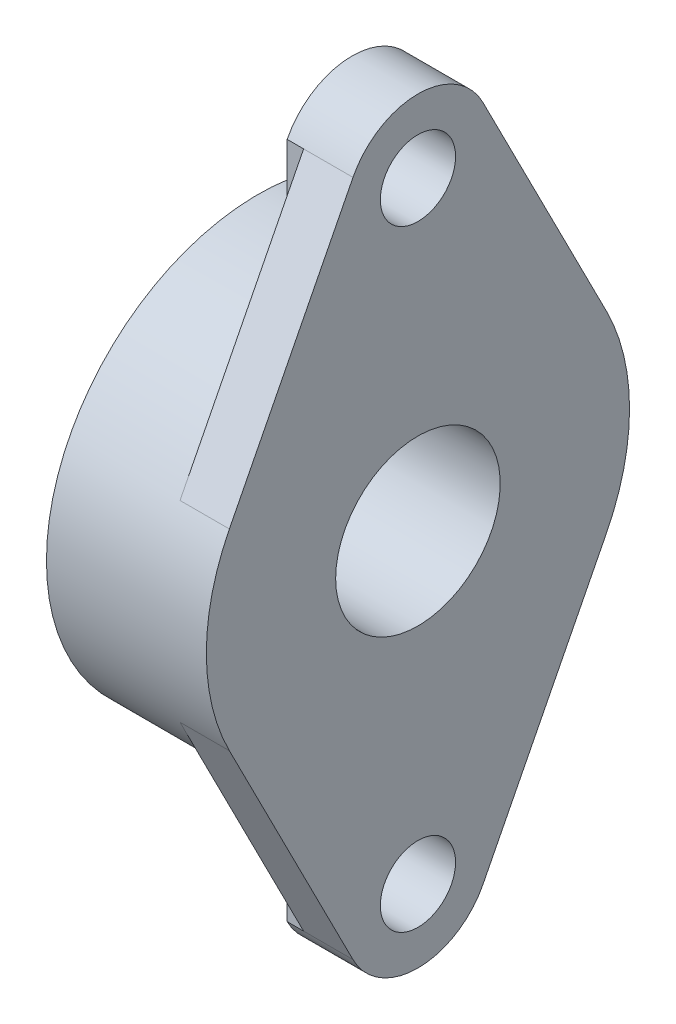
ISO-10303-21;
HEADER;
FILE_DESCRIPTION(('STEP AP214'),'2;1');
FILE_NAME('part.step','',(''),(''),'','','');
FILE_SCHEMA(('AUTOMOTIVE_DESIGN { 1 0 10303 214 1 1 1 1 }'));
ENDSEC;
DATA;
#1=APPLICATION_CONTEXT('core data for automotive mechanical design processes');
#2=APPLICATION_PROTOCOL_DEFINITION('international standard','automotive_design',2000,#1);
#3=PRODUCT_CONTEXT('',#1,'mechanical');
#4=PRODUCT('Part','Part','',(#3));
#5=PRODUCT_RELATED_PRODUCT_CATEGORY('part','',(#4));
#6=PRODUCT_DEFINITION_FORMATION('','',#4);
#7=PRODUCT_DEFINITION_CONTEXT('part definition',#1,'design');
#8=PRODUCT_DEFINITION('design','',#6,#7);
#9=PRODUCT_DEFINITION_SHAPE('','',#8);
#10=(LENGTH_UNIT() NAMED_UNIT(*) SI_UNIT(.MILLI.,.METRE.));
#11=(NAMED_UNIT(*) PLANE_ANGLE_UNIT() SI_UNIT($,.RADIAN.));
#12=(NAMED_UNIT(*) SI_UNIT($,.STERADIAN.) SOLID_ANGLE_UNIT());
#13=UNCERTAINTY_MEASURE_WITH_UNIT(LENGTH_MEASURE(1.E-05),#10,'distance_accuracy_value','');
#14=(GEOMETRIC_REPRESENTATION_CONTEXT(3) GLOBAL_UNCERTAINTY_ASSIGNED_CONTEXT((#13)) GLOBAL_UNIT_ASSIGNED_CONTEXT((#10,
#11,#12)) REPRESENTATION_CONTEXT('',''));
#15=CARTESIAN_POINT('',(0.,0.,0.));
#16=DIRECTION('',(0.,0.,1.));
#17=DIRECTION('',(1.,0.,0.));
#18=AXIS2_PLACEMENT_3D('',#15,#16,#17);
#19=CARTESIAN_POINT('',(-10.5,-72.3442608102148,-40.0986025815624));
#20=DIRECTION('',(-1.,0.,0.));
#21=DIRECTION('',(0.,0.,1.));
#22=AXIS2_PLACEMENT_3D('',#19,#20,#21);
#23=PLANE('',#22);
#24=DIRECTION('',(0.,-1.,0.));
#25=VECTOR('',#24,1.);
#26=CARTESIAN_POINT('',(-10.5,-57.4312973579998,-13.8117408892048));
#27=LINE('',#26,#25);
#28=CARTESIAN_POINT('',(-10.5,-42.8279793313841,-13.8117408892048));
#29=VERTEX_POINT('',#28);
#30=CARTESIAN_POINT('',(-10.5,-72.0346153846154,-13.8117408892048));
#31=VERTEX_POINT('',#30);
#32=EDGE_CURVE('E71',#29,#31,#27,.T.);
#33=ORIENTED_EDGE('',*,*,#32,.F.);
#34=CARTESIAN_POINT('',(-10.5,0.,0.));
#35=DIRECTION('',(-1.,0.,0.));
#36=DIRECTION('',(0.,0.,1.));
#37=AXIS2_PLACEMENT_3D('',#34,#35,#36);
#38=CIRCLE('',#37,45.);
#39=CARTESIAN_POINT('',(-10.5,-20.4270445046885,-40.096581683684));
#40=VERTEX_POINT('',#39);
#41=EDGE_CURVE('E208',#40,#29,#38,.T.);
#42=ORIENTED_EDGE('',*,*,#41,.F.);
#43=DIRECTION('',(0.,0.891080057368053,-0.453846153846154));
#44=VECTOR('',#43,1.);
#45=CARTESIAN_POINT('',(-10.5,-46.2288461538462,-26.9551717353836));
#46=LINE('',#45,#44);
#47=EDGE_CURVE('E308',#31,#40,#46,.T.);
#48=ORIENTED_EDGE('',*,*,#47,.F.);
#49=EDGE_LOOP('',(#33,#42,#48));
#50=FACE_BOUND('',#49,.T.);
#51=ADVANCED_FACE('F16',(#50),#23,.T.);
#52=CARTESIAN_POINT('',(-14.,-72.0346153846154,-13.8117408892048));
#53=DIRECTION('',(0.,0.,-1.));
#54=DIRECTION('',(0.,1.,0.));
#55=AXIS2_PLACEMENT_3D('',#52,#53,#54);
#56=PLANE('',#55);
#57=DIRECTION('',(0.,-1.,0.));
#58=VECTOR('',#57,1.);
#59=CARTESIAN_POINT('',(-14.,-61.8523497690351,-13.8117408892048));
#60=LINE('',#59,#58);
#61=CARTESIAN_POINT('',(-14.,-42.8279793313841,-13.8117408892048));
#62=VERTEX_POINT('',#61);
#63=CARTESIAN_POINT('',(-14.,-72.0346153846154,-13.8117408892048));
#64=VERTEX_POINT('',#63);
#65=EDGE_CURVE('E65',#62,#64,#60,.T.);
#66=ORIENTED_EDGE('',*,*,#65,.F.);
#67=DIRECTION('',(-1.,0.,0.));
#68=VECTOR('',#67,1.);
#69=CARTESIAN_POINT('',(-17.,-42.8279793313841,-13.8117408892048));
#70=LINE('',#69,#68);
#71=EDGE_CURVE('E300',#29,#62,#70,.T.);
#72=ORIENTED_EDGE('',*,*,#71,.F.);
#73=ORIENTED_EDGE('',*,*,#32,.T.);
#74=DIRECTION('',(1.,0.,0.));
#75=VECTOR('',#74,1.);
#76=CARTESIAN_POINT('',(-7.,-72.0346153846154,-13.8117408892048));
#77=LINE('',#76,#75);
#78=EDGE_CURVE('E316',#64,#31,#77,.T.);
#79=ORIENTED_EDGE('',*,*,#78,.F.);
#80=EDGE_LOOP('',(#66,#72,#73,#79));
#81=FACE_BOUND('',#80,.T.);
#82=ADVANCED_FACE('F482',(#81),#56,.T.);
#83=CARTESIAN_POINT('',(-10.5,20.1173989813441,-40.0986025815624));
#84=DIRECTION('',(-1.,0.,0.));
#85=DIRECTION('',(0.,0.,1.));
#86=AXIS2_PLACEMENT_3D('',#83,#84,#85);
#87=PLANE('',#86);
#88=CARTESIAN_POINT('',(-10.5,0.,0.));
#89=DIRECTION('',(-1.,0.,0.));
#90=DIRECTION('',(0.,0.,1.));
#91=AXIS2_PLACEMENT_3D('',#88,#89,#90);
#92=CIRCLE('',#91,45.);
#93=CARTESIAN_POINT('',(-10.5,42.8279793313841,-13.8117408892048));
#94=VERTEX_POINT('',#93);
#95=CARTESIAN_POINT('',(-10.5,20.4270444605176,-40.0965817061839));
#96=VERTEX_POINT('',#95);
#97=EDGE_CURVE('E360',#94,#96,#92,.T.);
#98=ORIENTED_EDGE('',*,*,#97,.F.);
#99=DIRECTION('',(0.,-1.,0.));
#100=VECTOR('',#99,1.);
#101=CARTESIAN_POINT('',(-10.5,57.4312973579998,-13.8117408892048));
#102=LINE('',#101,#100);
#103=CARTESIAN_POINT('',(-10.5,72.0346153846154,-13.8117408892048));
#104=VERTEX_POINT('',#103);
#105=EDGE_CURVE('E270',#104,#94,#102,.T.);
#106=ORIENTED_EDGE('',*,*,#105,.F.);
#107=DIRECTION('',(0.,0.891080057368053,0.453846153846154));
#108=VECTOR('',#107,1.);
#109=CARTESIAN_POINT('',(-10.5,46.2288461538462,-26.9551717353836));
#110=LINE('',#109,#108);
#111=EDGE_CURVE('E203',#96,#104,#110,.T.);
#112=ORIENTED_EDGE('',*,*,#111,.F.);
#113=EDGE_LOOP('',(#98,#106,#112));
#114=FACE_BOUND('',#113,.T.);
#115=ADVANCED_FACE('F371',(#114),#87,.T.);
#116=CARTESIAN_POINT('',(-14.,42.8279793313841,-13.8117408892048));
#117=DIRECTION('',(0.,0.,-1.));
#118=DIRECTION('',(0.,1.,0.));
#119=AXIS2_PLACEMENT_3D('',#116,#117,#118);
#120=PLANE('',#119);
#121=DIRECTION('',(0.,-1.,0.));
#122=VECTOR('',#121,1.);
#123=CARTESIAN_POINT('',(-14.,61.8523497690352,-13.8117408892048));
#124=LINE('',#123,#122);
#125=CARTESIAN_POINT('',(-14.,72.0346153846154,-13.8117408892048));
#126=VERTEX_POINT('',#125);
#127=CARTESIAN_POINT('',(-14.,42.8279793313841,-13.8117408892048));
#128=VERTEX_POINT('',#127);
#129=EDGE_CURVE('E245',#126,#128,#124,.T.);
#130=ORIENTED_EDGE('',*,*,#129,.F.);
#131=DIRECTION('',(-1.,0.,0.));
#132=VECTOR('',#131,1.);
#133=CARTESIAN_POINT('',(-7.,72.0346153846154,-13.8117408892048));
#134=LINE('',#133,#132);
#135=EDGE_CURVE('E197',#104,#126,#134,.T.);
#136=ORIENTED_EDGE('',*,*,#135,.F.);
#137=ORIENTED_EDGE('',*,*,#105,.T.);
#138=DIRECTION('',(1.,0.,0.));
#139=VECTOR('',#138,1.);
#140=CARTESIAN_POINT('',(-17.,42.8279793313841,-13.8117408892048));
#141=LINE('',#140,#139);
#142=EDGE_CURVE('E215',#128,#94,#141,.T.);
#143=ORIENTED_EDGE('',*,*,#142,.F.);
#144=EDGE_LOOP('',(#130,#136,#137,#143));
#145=FACE_BOUND('',#144,.T.);
#146=ADVANCED_FACE('F366',(#145),#120,.T.);
#147=CARTESIAN_POINT('',(-14.,-42.8279793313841,13.8117408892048));
#148=DIRECTION('',(0.,0.,1.));
#149=DIRECTION('',(0.,-1.,0.));
#150=AXIS2_PLACEMENT_3D('',#147,#148,#149);
#151=PLANE('',#150);
#152=DIRECTION('',(0.,1.,0.));
#153=VECTOR('',#152,1.);
#154=CARTESIAN_POINT('',(-14.,-61.8523497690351,13.8117408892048));
#155=LINE('',#154,#153);
#156=CARTESIAN_POINT('',(-14.,-72.0346153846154,13.8117408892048));
#157=VERTEX_POINT('',#156);
#158=CARTESIAN_POINT('',(-14.,-42.8279793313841,13.8117408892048));
#159=VERTEX_POINT('',#158);
#160=EDGE_CURVE('E59',#157,#159,#155,.T.);
#161=ORIENTED_EDGE('',*,*,#160,.F.);
#162=DIRECTION('',(-1.,0.,0.));
#163=VECTOR('',#162,1.);
#164=CARTESIAN_POINT('',(-7.,-72.0346153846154,13.8117408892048));
#165=LINE('',#164,#163);
#166=CARTESIAN_POINT('',(-10.5,-72.0346153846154,13.8117408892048));
#167=VERTEX_POINT('',#166);
#168=EDGE_CURVE('E257',#167,#157,#165,.T.);
#169=ORIENTED_EDGE('',*,*,#168,.F.);
#170=DIRECTION('',(0.,1.,0.));
#171=VECTOR('',#170,1.);
#172=CARTESIAN_POINT('',(-10.5,-72.0346153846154,13.8117408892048));
#173=LINE('',#172,#171);
#174=CARTESIAN_POINT('',(-10.5,-42.8279793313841,13.8117408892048));
#175=VERTEX_POINT('',#174);
#176=EDGE_CURVE('E251',#175,#167,#173,.F.);
#177=ORIENTED_EDGE('',*,*,#176,.F.);
#178=DIRECTION('',(1.,0.,0.));
#179=VECTOR('',#178,1.);
#180=CARTESIAN_POINT('',(-17.,-42.8279793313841,13.8117408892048));
#181=LINE('',#180,#179);
#182=EDGE_CURVE('E277',#159,#175,#181,.T.);
#183=ORIENTED_EDGE('',*,*,#182,.F.);
#184=EDGE_LOOP('',(#161,#169,#177,#183));
#185=FACE_BOUND('',#184,.T.);
#186=ADVANCED_FACE('F432',(#185),#151,.T.);
#187=CARTESIAN_POINT('',(-10.5,20.1173990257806,13.8117408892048));
#188=DIRECTION('',(-1.,0.,0.));
#189=DIRECTION('',(0.,0.,1.));
#190=AXIS2_PLACEMENT_3D('',#187,#188,#189);
#191=PLANE('',#190);
#192=DIRECTION('',(0.,1.,0.));
#193=VECTOR('',#192,1.);
#194=CARTESIAN_POINT('',(-10.5,57.4312973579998,13.8117408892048));
#195=LINE('',#194,#193);
#196=CARTESIAN_POINT('',(-10.5,42.8279793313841,13.8117408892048));
#197=VERTEX_POINT('',#196);
#198=CARTESIAN_POINT('',(-10.5,72.0346153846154,13.8117408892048));
#199=VERTEX_POINT('',#198);
#200=EDGE_CURVE('E133',#197,#199,#195,.T.);
#201=ORIENTED_EDGE('',*,*,#200,.F.);
#202=CARTESIAN_POINT('',(-10.5,0.,0.));
#203=DIRECTION('',(-1.,0.,0.));
#204=DIRECTION('',(0.,0.,1.));
#205=AXIS2_PLACEMENT_3D('',#202,#203,#204);
#206=CIRCLE('',#205,45.);
#207=CARTESIAN_POINT('',(-10.5,20.4270445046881,40.0965816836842));
#208=VERTEX_POINT('',#207);
#209=EDGE_CURVE('E184',#208,#197,#206,.T.);
#210=ORIENTED_EDGE('',*,*,#209,.F.);
#211=DIRECTION('',(0.,-0.891080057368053,0.453846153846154));
#212=VECTOR('',#211,1.);
#213=CARTESIAN_POINT('',(-10.5,46.2288461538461,26.9551717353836));
#214=LINE('',#213,#212);
#215=EDGE_CURVE('E274',#199,#208,#214,.T.);
#216=ORIENTED_EDGE('',*,*,#215,.F.);
#217=EDGE_LOOP('',(#201,#210,#216));
#218=FACE_BOUND('',#217,.T.);
#219=ADVANCED_FACE('F420',(#218),#191,.T.);
#220=CARTESIAN_POINT('',(-14.,72.0346153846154,13.8117408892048));
#221=DIRECTION('',(0.,0.,1.));
#222=DIRECTION('',(0.,-1.,0.));
#223=AXIS2_PLACEMENT_3D('',#220,#221,#222);
#224=PLANE('',#223);
#225=DIRECTION('',(0.,1.,0.));
#226=VECTOR('',#225,1.);
#227=CARTESIAN_POINT('',(-14.,61.8523497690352,13.8117408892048));
#228=LINE('',#227,#226);
#229=CARTESIAN_POINT('',(-14.,42.8279793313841,13.8117408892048));
#230=VERTEX_POINT('',#229);
#231=CARTESIAN_POINT('',(-14.,72.0346153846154,13.8117408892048));
#232=VERTEX_POINT('',#231);
#233=EDGE_CURVE('E128',#230,#232,#228,.T.);
#234=ORIENTED_EDGE('',*,*,#233,.F.);
#235=DIRECTION('',(-1.,0.,0.));
#236=VECTOR('',#235,1.);
#237=CARTESIAN_POINT('',(-17.,42.8279793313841,13.8117408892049));
#238=LINE('',#237,#236);
#239=EDGE_CURVE('E267',#197,#230,#238,.T.);
#240=ORIENTED_EDGE('',*,*,#239,.F.);
#241=ORIENTED_EDGE('',*,*,#200,.T.);
#242=DIRECTION('',(1.,0.,0.));
#243=VECTOR('',#242,1.);
#244=CARTESIAN_POINT('',(-7.,72.0346153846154,13.8117408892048));
#245=LINE('',#244,#243);
#246=EDGE_CURVE('E284',#232,#199,#245,.T.);
#247=ORIENTED_EDGE('',*,*,#246,.F.);
#248=EDGE_LOOP('',(#234,#240,#241,#247));
#249=FACE_BOUND('',#248,.T.);
#250=ADVANCED_FACE('F424',(#249),#224,.T.);
#251=CARTESIAN_POINT('',(-10.5,-72.3442608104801,13.8117408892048));
#252=DIRECTION('',(-1.,0.,0.));
#253=DIRECTION('',(0.,0.,1.));
#254=AXIS2_PLACEMENT_3D('',#251,#252,#253);
#255=PLANE('',#254);
#256=CARTESIAN_POINT('',(-10.5,0.,0.));
#257=DIRECTION('',(-1.,0.,0.));
#258=DIRECTION('',(0.,0.,1.));
#259=AXIS2_PLACEMENT_3D('',#256,#257,#258);
#260=CIRCLE('',#259,45.);
#261=CARTESIAN_POINT('',(-10.5,-20.427044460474,40.0965817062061));
#262=VERTEX_POINT('',#261);
#263=EDGE_CURVE('E154',#175,#262,#260,.T.);
#264=ORIENTED_EDGE('',*,*,#263,.F.);
#265=ORIENTED_EDGE('',*,*,#176,.T.);
#266=DIRECTION('',(0.,-0.891080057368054,-0.453846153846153));
#267=VECTOR('',#266,1.);
#268=CARTESIAN_POINT('',(-10.5,-46.2288461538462,26.9551717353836));
#269=LINE('',#268,#267);
#270=EDGE_CURVE('E171',#262,#167,#269,.T.);
#271=ORIENTED_EDGE('',*,*,#270,.F.);
#272=EDGE_LOOP('',(#264,#265,#271));
#273=FACE_BOUND('',#272,.T.);
#274=ADVANCED_FACE('F238',(#273),#255,.T.);
#275=CARTESIAN_POINT('',(-14.,42.8279793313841,13.8117408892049));
#276=CARTESIAN_POINT('',(-14.,80.5,13.8117408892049));
#277=CARTESIAN_POINT('',(-14.,80.8767202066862,13.8117408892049));
#278=B_SPLINE_CURVE_WITH_KNOTS('',1,(#275,#276,#277),.UNSPECIFIED.,.F.,.F.,(2,1,2),(0.,1.,1.01),.UNSPECIFIED.);
#279=DIRECTION('',(0.,0.,-1.));
#280=VECTOR('',#279,1.);
#281=SURFACE_OF_LINEAR_EXTRUSION('',#278,#280);
#282=CARTESIAN_POINT('',(-14.,65.,0.));
#283=DIRECTION('',(1.,0.,0.));
#284=DIRECTION('',(0.,0.,-1.));
#285=AXIS2_PLACEMENT_3D('',#282,#283,#284);
#286=CIRCLE('',#285,7.99999999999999);
#287=CARTESIAN_POINT('',(-14.,65.,-7.99999999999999));
#288=VERTEX_POINT('',#287);
#289=EDGE_CURVE('E165',#288,#288,#286,.F.);
#290=ORIENTED_EDGE('',*,*,#289,.F.);
#291=EDGE_LOOP('',(#290));
#292=FACE_BOUND('',#291,.T.);
#293=ORIENTED_EDGE('',*,*,#129,.T.);
#294=CARTESIAN_POINT('',(-14.,0.,0.));
#295=DIRECTION('',(-1.,0.,0.));
#296=DIRECTION('',(0.,0.,1.));
#297=AXIS2_PLACEMENT_3D('',#294,#295,#296);
#298=CIRCLE('',#297,45.);
#299=EDGE_CURVE('E261',#230,#128,#298,.T.);
#300=ORIENTED_EDGE('',*,*,#299,.F.);
#301=ORIENTED_EDGE('',*,*,#233,.T.);
#302=CARTESIAN_POINT('',(-14.,65.,0.));
#303=DIRECTION('',(1.,0.,0.));
#304=DIRECTION('',(0.,0.,-1.));
#305=AXIS2_PLACEMENT_3D('',#302,#303,#304);
#306=CIRCLE('',#305,15.5);
#307=EDGE_CURVE('E288',#126,#232,#306,.T.);
#308=ORIENTED_EDGE('',*,*,#307,.F.);
#309=EDGE_LOOP('',(#293,#300,#301,#308));
#310=FACE_BOUND('',#309,.T.);
#311=ADVANCED_FACE('F232',(#292,#310),#281,.T.);
#312=CARTESIAN_POINT('',(-14.,-80.8767202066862,13.8117408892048));
#313=CARTESIAN_POINT('',(-14.,-80.5,13.8117408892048));
#314=CARTESIAN_POINT('',(-14.,-42.8279793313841,13.8117408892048));
#315=B_SPLINE_CURVE_WITH_KNOTS('',1,(#312,#313,#314),.UNSPECIFIED.,.F.,.F.,(2,1,2),(-0.01,0.,
1.),.UNSPECIFIED.);
#316=DIRECTION('',(0.,0.,-1.));
#317=VECTOR('',#316,1.);
#318=SURFACE_OF_LINEAR_EXTRUSION('',#315,#317);
#319=CARTESIAN_POINT('',(-14.,-65.,0.));
#320=DIRECTION('',(1.,0.,0.));
#321=DIRECTION('',(0.,0.,-1.));
#322=AXIS2_PLACEMENT_3D('',#319,#320,#321);
#323=CIRCLE('',#322,8.);
#324=CARTESIAN_POINT('',(-14.,-65.,-8.));
#325=VERTEX_POINT('',#324);
#326=EDGE_CURVE('E169',#325,#325,#323,.F.);
#327=ORIENTED_EDGE('',*,*,#326,.F.);
#328=EDGE_LOOP('',(#327));
#329=FACE_BOUND('',#328,.T.);
#330=ORIENTED_EDGE('',*,*,#65,.T.);
#331=CARTESIAN_POINT('',(-14.,-65.,0.));
#332=DIRECTION('',(1.,0.,0.));
#333=DIRECTION('',(0.,0.,-1.));
#334=AXIS2_PLACEMENT_3D('',#331,#332,#333);
#335=CIRCLE('',#334,15.5);
#336=EDGE_CURVE('E19',#157,#64,#335,.T.);
#337=ORIENTED_EDGE('',*,*,#336,.F.);
#338=ORIENTED_EDGE('',*,*,#160,.T.);
#339=CARTESIAN_POINT('',(-14.,0.,0.));
#340=DIRECTION('',(-1.,0.,0.));
#341=DIRECTION('',(0.,0.,1.));
#342=AXIS2_PLACEMENT_3D('',#339,#340,#341);
#343=CIRCLE('',#342,45.);
#344=EDGE_CURVE('E353',#62,#159,#343,.T.);
#345=ORIENTED_EDGE('',*,*,#344,.F.);
#346=EDGE_LOOP('',(#330,#337,#338,#345));
#347=FACE_BOUND('',#346,.T.);
#348=ADVANCED_FACE('F227',(#329,#347),#318,.T.);
#349=CARTESIAN_POINT('',(-34.,-45.,45.5400021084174));
#350=DIRECTION('',(-1.,0.,0.));
#351=DIRECTION('',(0.,1.,0.));
#352=AXIS2_PLACEMENT_3D('',#349,#350,#351);
#353=PLANE('',#352);
#354=CARTESIAN_POINT('',(-34.,0.,0.));
#355=DIRECTION('',(-1.,0.,0.));
#356=DIRECTION('',(0.,0.,1.));
#357=AXIS2_PLACEMENT_3D('',#354,#355,#356);
#358=CIRCLE('',#357,26.25);
#359=CARTESIAN_POINT('',(-34.,0.,26.25));
#360=VERTEX_POINT('',#359);
#361=EDGE_CURVE('E344',#360,#360,#358,.T.);
#362=ORIENTED_EDGE('',*,*,#361,.F.);
#363=EDGE_LOOP('',(#362));
#364=FACE_BOUND('',#363,.T.);
#365=CARTESIAN_POINT('',(-34.,0.,0.));
#366=DIRECTION('',(-1.,0.,0.));
#367=DIRECTION('',(0.,0.,1.));
#368=AXIS2_PLACEMENT_3D('',#365,#366,#367);
#369=CIRCLE('',#368,45.);
#370=CARTESIAN_POINT('',(-34.,0.,45.));
#371=VERTEX_POINT('',#370);
#372=EDGE_CURVE('E190',#371,#371,#369,.F.);
#373=ORIENTED_EDGE('',*,*,#372,.F.);
#374=EDGE_LOOP('',(#373));
#375=FACE_BOUND('',#374,.T.);
#376=ADVANCED_FACE('F231',(#364,#375),#353,.T.);
#377=CARTESIAN_POINT('',(0.,-65.,0.));
#378=DIRECTION('',(1.,0.,0.));
#379=DIRECTION('',(0.,0.,-1.));
#380=AXIS2_PLACEMENT_3D('',#377,#378,#379);
#381=CYLINDRICAL_SURFACE('',#380,15.5);
#382=ORIENTED_EDGE('',*,*,#336,.T.);
#383=ORIENTED_EDGE('',*,*,#78,.T.);
#384=DIRECTION('',(1.,0.,0.));
#385=VECTOR('',#384,1.);
#386=CARTESIAN_POINT('',(-10.5,-72.0346153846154,-13.8117408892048));
#387=LINE('',#386,#385);
#388=CARTESIAN_POINT('',(0.,-72.0346153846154,-13.8117408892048));
#389=VERTEX_POINT('',#388);
#390=EDGE_CURVE('E212',#389,#31,#387,.F.);
#391=ORIENTED_EDGE('',*,*,#390,.F.);
#392=CARTESIAN_POINT('',(0.,-65.,0.));
#393=DIRECTION('',(1.,0.,0.));
#394=DIRECTION('',(0.,0.,-1.));
#395=AXIS2_PLACEMENT_3D('',#392,#393,#394);
#396=CIRCLE('',#395,15.5);
#397=CARTESIAN_POINT('',(0.,-72.0346153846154,13.8117408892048));
#398=VERTEX_POINT('',#397);
#399=EDGE_CURVE('E341',#398,#389,#396,.T.);
#400=ORIENTED_EDGE('',*,*,#399,.F.);
#401=DIRECTION('',(1.,0.,0.));
#402=VECTOR('',#401,1.);
#403=CARTESIAN_POINT('',(-10.5,-72.0346153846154,13.8117408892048));
#404=LINE('',#403,#402);
#405=EDGE_CURVE('E166',#167,#398,#404,.T.);
#406=ORIENTED_EDGE('',*,*,#405,.F.);
#407=ORIENTED_EDGE('',*,*,#168,.T.);
#408=EDGE_LOOP('',(#382,#383,#391,#400,#406,#407));
#409=FACE_BOUND('',#408,.T.);
#410=ADVANCED_FACE('F454',(#409),#381,.T.);
#411=CARTESIAN_POINT('',(-10.5,-72.0346153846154,-13.8117408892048));
#412=DIRECTION('',(0.,-0.453846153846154,-0.891080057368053));
#413=DIRECTION('',(0.,0.891080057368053,-0.453846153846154));
#414=AXIS2_PLACEMENT_3D('',#411,#412,#413);
#415=PLANE('',#414);
#416=CARTESIAN_POINT('',(0.,-72.0346153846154,-13.8117408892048));
#417=CARTESIAN_POINT('',(0.,-69.8841346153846,-14.9070267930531));
#418=CARTESIAN_POINT('',(0.,-67.7336538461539,-16.0023126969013));
#419=CARTESIAN_POINT('',(0.,-63.4326923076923,-18.1928845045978));
#420=CARTESIAN_POINT('',(0.,-61.2822115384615,-19.288170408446));
#421=CARTESIAN_POINT('',(0.,-56.98125,-21.4787422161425));
#422=CARTESIAN_POINT('',(0.,-54.8307692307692,-22.5740281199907));
#423=CARTESIAN_POINT('',(0.,-50.5298076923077,-24.7645999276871));
#424=CARTESIAN_POINT('',(0.,-48.3793269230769,-25.8598858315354));
#425=CARTESIAN_POINT('',(0.,-44.0783653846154,-28.0504576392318));
#426=CARTESIAN_POINT('',(0.,-41.9278846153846,-29.1457435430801));
#427=CARTESIAN_POINT('',(0.,-37.6269230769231,-31.3363153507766));
#428=CARTESIAN_POINT('',(0.,-35.4764423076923,-32.4316012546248));
#429=CARTESIAN_POINT('',(0.,-31.1754807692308,-34.6221730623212));
#430=CARTESIAN_POINT('',(0.,-29.025,-35.7174589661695));
#431=CARTESIAN_POINT('',(0.,-24.7240384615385,-37.9080307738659));
#432=CARTESIAN_POINT('',(0.,-22.5735576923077,-39.0033166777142));
#433=CARTESIAN_POINT('',(0.,-20.4230769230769,-40.0986025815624));
#434=B_SPLINE_CURVE_WITH_KNOTS('',3,(#416,#417,#418,#419,#420,#421,#422,#423,#424,#425,#426,
#427,#428,#429,#430,#431,#432,#433),.UNSPECIFIED.,.F.,.F.,(4,2,2,2,2,2,2,2,4),(0.,
7.24002546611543,14.4800509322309,21.7200763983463,28.9601018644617,36.2001273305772,
43.4401527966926,50.680178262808,57.9202037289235),.UNSPECIFIED.);
#435=CARTESIAN_POINT('',(0.,-20.4230769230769,-40.0986025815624));
#436=VERTEX_POINT('',#435);
#437=EDGE_CURVE('E340',#389,#436,#434,.T.);
#438=ORIENTED_EDGE('',*,*,#437,.F.);
#439=ORIENTED_EDGE('',*,*,#390,.T.);
#440=ORIENTED_EDGE('',*,*,#47,.T.);
#441=CARTESIAN_POINT('',(-10.5,-20.4230769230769,-40.0986025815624));
#442=VERTEX_POINT('',#441);
#443=EDGE_CURVE('E34',#40,#442,#46,.T.);
#444=ORIENTED_EDGE('',*,*,#443,.T.);
#445=DIRECTION('',(-1.,0.,0.));
#446=VECTOR('',#445,1.);
#447=CARTESIAN_POINT('',(-17.,-20.4230769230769,-40.0986025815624));
#448=LINE('',#447,#446);
#449=EDGE_CURVE('E206',#436,#442,#448,.T.);
#450=ORIENTED_EDGE('',*,*,#449,.F.);
#451=EDGE_LOOP('',(#438,#439,#440,#444,#450));
#452=FACE_BOUND('',#451,.T.);
#453=ADVANCED_FACE('F472',(#452),#415,.T.);
#454=CARTESIAN_POINT('',(-10.5,20.4230769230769,-40.0986025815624));
#455=DIRECTION('',(0.,0.453846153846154,-0.891080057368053));
#456=DIRECTION('',(0.,0.891080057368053,0.453846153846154));
#457=AXIS2_PLACEMENT_3D('',#454,#455,#456);
#458=PLANE('',#457);
#459=CARTESIAN_POINT('',(0.,20.4230769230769,-40.0986025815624));
#460=CARTESIAN_POINT('',(0.,22.5735576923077,-39.0033166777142));
#461=CARTESIAN_POINT('',(0.,24.7240384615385,-37.9080307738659));
#462=CARTESIAN_POINT('',(0.,29.025,-35.7174589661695));
#463=CARTESIAN_POINT('',(0.,31.1754807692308,-34.6221730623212));
#464=CARTESIAN_POINT('',(0.,35.4764423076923,-32.4316012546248));
#465=CARTESIAN_POINT('',(0.,37.6269230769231,-31.3363153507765));
#466=CARTESIAN_POINT('',(0.,41.9278846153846,-29.1457435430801));
#467=CARTESIAN_POINT('',(0.,44.0783653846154,-28.0504576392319));
#468=CARTESIAN_POINT('',(0.,48.3793269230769,-25.8598858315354));
#469=CARTESIAN_POINT('',(0.,50.5298076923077,-24.7645999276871));
#470=CARTESIAN_POINT('',(0.,54.8307692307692,-22.5740281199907));
#471=CARTESIAN_POINT('',(0.,56.98125,-21.4787422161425));
#472=CARTESIAN_POINT('',(0.,61.2822115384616,-19.288170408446));
#473=CARTESIAN_POINT('',(0.,63.4326923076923,-18.1928845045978));
#474=CARTESIAN_POINT('',(0.,67.7336538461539,-16.0023126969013));
#475=CARTESIAN_POINT('',(0.,69.8841346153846,-14.907026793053));
#476=CARTESIAN_POINT('',(0.,72.0346153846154,-13.8117408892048));
#477=B_SPLINE_CURVE_WITH_KNOTS('',3,(#459,#460,#461,#462,#463,#464,#465,#466,#467,#468,#469,
#470,#471,#472,#473,#474,#475,#476),.UNSPECIFIED.,.F.,.F.,(4,2,2,2,2,2,2,2,4),(0.,
7.24002546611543,14.4800509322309,21.7200763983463,28.9601018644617,36.2001273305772,
43.4401527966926,50.680178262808,57.9202037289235),.UNSPECIFIED.);
#478=CARTESIAN_POINT('',(0.,20.4230769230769,-40.0986025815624));
#479=VERTEX_POINT('',#478);
#480=CARTESIAN_POINT('',(0.,72.0346153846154,-13.8117408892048));
#481=VERTEX_POINT('',#480);
#482=EDGE_CURVE('E336',#479,#481,#477,.T.);
#483=ORIENTED_EDGE('',*,*,#482,.F.);
#484=DIRECTION('',(1.,0.,0.));
#485=VECTOR('',#484,1.);
#486=CARTESIAN_POINT('',(-10.5,20.4230769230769,-40.0986025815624));
#487=LINE('',#486,#485);
#488=CARTESIAN_POINT('',(-10.5,20.4230769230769,-40.0986025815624));
#489=VERTEX_POINT('',#488);
#490=EDGE_CURVE('E198',#479,#489,#487,.F.);
#491=ORIENTED_EDGE('',*,*,#490,.T.);
#492=CARTESIAN_POINT('',(-10.5,0.,0.));
#493=DIRECTION('',(-1.,0.,0.));
#494=DIRECTION('',(0.,1.,0.));
#495=AXIS2_PLACEMENT_3D('',#492,#493,#494);
#496=CIRCLE('',#495,45.);
#497=EDGE_CURVE('E209',#96,#489,#496,.T.);
#498=ORIENTED_EDGE('',*,*,#497,.F.);
#499=ORIENTED_EDGE('',*,*,#111,.T.);
#500=DIRECTION('',(-1.,0.,0.));
#501=VECTOR('',#500,1.);
#502=CARTESIAN_POINT('',(-7.,72.0346153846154,-13.8117408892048));
#503=LINE('',#502,#501);
#504=EDGE_CURVE('E194',#481,#104,#503,.T.);
#505=ORIENTED_EDGE('',*,*,#504,.F.);
#506=EDGE_LOOP('',(#483,#491,#498,#499,#505));
#507=FACE_BOUND('',#506,.T.);
#508=ADVANCED_FACE('F374',(#507),#458,.T.);
#509=CARTESIAN_POINT('',(0.,65.,0.));
#510=DIRECTION('',(1.,0.,0.));
#511=DIRECTION('',(0.,0.,-1.));
#512=AXIS2_PLACEMENT_3D('',#509,#510,#511);
#513=CYLINDRICAL_SURFACE('',#512,15.5);
#514=ORIENTED_EDGE('',*,*,#307,.T.);
#515=ORIENTED_EDGE('',*,*,#246,.T.);
#516=DIRECTION('',(1.,0.,0.));
#517=VECTOR('',#516,1.);
#518=CARTESIAN_POINT('',(-10.5,72.0346153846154,13.8117408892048));
#519=LINE('',#518,#517);
#520=CARTESIAN_POINT('',(0.,72.0346153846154,13.8117408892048));
#521=VERTEX_POINT('',#520);
#522=EDGE_CURVE('E187',#521,#199,#519,.F.);
#523=ORIENTED_EDGE('',*,*,#522,.F.);
#524=CARTESIAN_POINT('',(0.,65.,0.));
#525=DIRECTION('',(1.,0.,0.));
#526=DIRECTION('',(0.,0.,-1.));
#527=AXIS2_PLACEMENT_3D('',#524,#525,#526);
#528=CIRCLE('',#527,15.5);
#529=EDGE_CURVE('E333',#481,#521,#528,.T.);
#530=ORIENTED_EDGE('',*,*,#529,.F.);
#531=ORIENTED_EDGE('',*,*,#504,.T.);
#532=ORIENTED_EDGE('',*,*,#135,.T.);
#533=EDGE_LOOP('',(#514,#515,#523,#530,#531,#532));
#534=FACE_BOUND('',#533,.T.);
#535=ADVANCED_FACE('F423',(#534),#513,.T.);
#536=CARTESIAN_POINT('',(-10.5,72.0346153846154,13.8117408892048));
#537=DIRECTION('',(0.,0.453846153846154,0.891080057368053));
#538=DIRECTION('',(0.,-0.891080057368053,0.453846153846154));
#539=AXIS2_PLACEMENT_3D('',#536,#537,#538);
#540=PLANE('',#539);
#541=CARTESIAN_POINT('',(0.,72.0346153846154,13.8117408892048));
#542=CARTESIAN_POINT('',(0.,69.8841346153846,14.9070267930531));
#543=CARTESIAN_POINT('',(0.,67.7336538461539,16.0023126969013));
#544=CARTESIAN_POINT('',(0.,63.4326923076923,18.1928845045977));
#545=CARTESIAN_POINT('',(0.,61.2822115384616,19.288170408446));
#546=CARTESIAN_POINT('',(0.,56.98125,21.4787422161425));
#547=CARTESIAN_POINT('',(0.,54.8307692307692,22.5740281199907));
#548=CARTESIAN_POINT('',(0.,50.5298076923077,24.7645999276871));
#549=CARTESIAN_POINT('',(0.,48.3793269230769,25.8598858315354));
#550=CARTESIAN_POINT('',(0.,44.0783653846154,28.0504576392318));
#551=CARTESIAN_POINT('',(0.,41.9278846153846,29.1457435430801));
#552=CARTESIAN_POINT('',(0.,37.6269230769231,31.3363153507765));
#553=CARTESIAN_POINT('',(0.,35.4764423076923,32.4316012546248));
#554=CARTESIAN_POINT('',(0.,31.1754807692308,34.6221730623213));
#555=CARTESIAN_POINT('',(0.,29.025,35.7174589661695));
#556=CARTESIAN_POINT('',(0.,24.7240384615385,37.9080307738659));
#557=CARTESIAN_POINT('',(0.,22.5735576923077,39.0033166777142));
#558=CARTESIAN_POINT('',(0.,20.4230769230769,40.0986025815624));
#559=B_SPLINE_CURVE_WITH_KNOTS('',3,(#541,#542,#543,#544,#545,#546,#547,#548,#549,#550,#551,
#552,#553,#554,#555,#556,#557,#558),.UNSPECIFIED.,.F.,.F.,(4,2,2,2,2,2,2,2,4),(0.,
7.24002546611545,14.4800509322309,21.7200763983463,28.9601018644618,36.2001273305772,
43.4401527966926,50.6801782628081,57.9202037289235),.UNSPECIFIED.);
#560=CARTESIAN_POINT('',(0.,20.4230769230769,40.0986025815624));
#561=VERTEX_POINT('',#560);
#562=EDGE_CURVE('E332',#521,#561,#559,.T.);
#563=ORIENTED_EDGE('',*,*,#562,.F.);
#564=ORIENTED_EDGE('',*,*,#522,.T.);
#565=ORIENTED_EDGE('',*,*,#215,.T.);
#566=CARTESIAN_POINT('',(-10.5,20.4230769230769,40.0986025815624));
#567=VERTEX_POINT('',#566);
#568=EDGE_CURVE('E191',#208,#567,#214,.T.);
#569=ORIENTED_EDGE('',*,*,#568,.T.);
#570=DIRECTION('',(-1.,0.,0.));
#571=VECTOR('',#570,1.);
#572=CARTESIAN_POINT('',(-17.,20.4230769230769,40.0986025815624));
#573=LINE('',#572,#571);
#574=EDGE_CURVE('E158',#561,#567,#573,.T.);
#575=ORIENTED_EDGE('',*,*,#574,.F.);
#576=EDGE_LOOP('',(#563,#564,#565,#569,#575));
#577=FACE_BOUND('',#576,.T.);
#578=ADVANCED_FACE('F417',(#577),#540,.T.);
#579=CARTESIAN_POINT('',(-34.,0.,0.));
#580=DIRECTION('',(-1.,0.,0.));
#581=DIRECTION('',(0.,0.,1.));
#582=AXIS2_PLACEMENT_3D('',#579,#580,#581);
#583=CYLINDRICAL_SURFACE('',#582,45.);
#584=ORIENTED_EDGE('',*,*,#372,.T.);
#585=EDGE_LOOP('',(#584));
#586=FACE_BOUND('',#585,.T.);
#587=ORIENTED_EDGE('',*,*,#239,.T.);
#588=ORIENTED_EDGE('',*,*,#299,.T.);
#589=ORIENTED_EDGE('',*,*,#142,.T.);
#590=ORIENTED_EDGE('',*,*,#97,.T.);
#591=ORIENTED_EDGE('',*,*,#497,.T.);
#592=ORIENTED_EDGE('',*,*,#490,.F.);
#593=CARTESIAN_POINT('',(0.,0.,0.));
#594=DIRECTION('',(-1.,0.,0.));
#595=DIRECTION('',(0.,0.,1.));
#596=AXIS2_PLACEMENT_3D('',#593,#594,#595);
#597=CIRCLE('',#596,45.);
#598=EDGE_CURVE('E337',#436,#479,#597,.F.);
#599=ORIENTED_EDGE('',*,*,#598,.F.);
#600=ORIENTED_EDGE('',*,*,#449,.T.);
#601=ORIENTED_EDGE('',*,*,#443,.F.);
#602=ORIENTED_EDGE('',*,*,#41,.T.);
#603=ORIENTED_EDGE('',*,*,#71,.T.);
#604=ORIENTED_EDGE('',*,*,#344,.T.);
#605=ORIENTED_EDGE('',*,*,#182,.T.);
#606=ORIENTED_EDGE('',*,*,#263,.T.);
#607=CARTESIAN_POINT('',(-10.5,0.,0.));
#608=DIRECTION('',(-1.,0.,0.));
#609=DIRECTION('',(0.,1.,0.));
#610=AXIS2_PLACEMENT_3D('',#607,#608,#609);
#611=CIRCLE('',#610,45.);
#612=CARTESIAN_POINT('',(-10.5,-20.4230769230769,40.0986025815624));
#613=VERTEX_POINT('',#612);
#614=EDGE_CURVE('E145',#262,#613,#611,.T.);
#615=ORIENTED_EDGE('',*,*,#614,.T.);
#616=DIRECTION('',(1.,0.,0.));
#617=VECTOR('',#616,1.);
#618=CARTESIAN_POINT('',(-10.5,-20.4230769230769,40.0986025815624));
#619=LINE('',#618,#617);
#620=CARTESIAN_POINT('',(0.,-20.4230769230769,40.0986025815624));
#621=VERTEX_POINT('',#620);
#622=EDGE_CURVE('E150',#621,#613,#619,.F.);
#623=ORIENTED_EDGE('',*,*,#622,.F.);
#624=CARTESIAN_POINT('',(0.,0.,0.));
#625=DIRECTION('',(-1.,0.,0.));
#626=DIRECTION('',(0.,0.,1.));
#627=AXIS2_PLACEMENT_3D('',#624,#625,#626);
#628=CIRCLE('',#627,45.);
#629=EDGE_CURVE('E330',#561,#621,#628,.F.);
#630=ORIENTED_EDGE('',*,*,#629,.F.);
#631=ORIENTED_EDGE('',*,*,#574,.T.);
#632=ORIENTED_EDGE('',*,*,#568,.F.);
#633=ORIENTED_EDGE('',*,*,#209,.T.);
#634=EDGE_LOOP('',(#587,#588,#589,#590,#591,#592,#599,#600,#601,#602,#603,#604,#605,#606,#615,
#623,#630,#631,#632,#633));
#635=FACE_BOUND('',#634,.T.);
#636=ADVANCED_FACE('F148',(#586,#635),#583,.T.);
#637=CARTESIAN_POINT('',(-10.5,-20.4230769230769,40.0986025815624));
#638=DIRECTION('',(0.,-0.453846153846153,0.891080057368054));
#639=DIRECTION('',(0.,-0.891080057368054,-0.453846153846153));
#640=AXIS2_PLACEMENT_3D('',#637,#638,#639);
#641=PLANE('',#640);
#642=CARTESIAN_POINT('',(0.,-20.4230769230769,40.0986025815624));
#643=CARTESIAN_POINT('',(0.,-22.5735576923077,39.0033166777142));
#644=CARTESIAN_POINT('',(0.,-24.7240384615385,37.9080307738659));
#645=CARTESIAN_POINT('',(0.,-29.025,35.7174589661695));
#646=CARTESIAN_POINT('',(0.,-31.1754807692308,34.6221730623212));
#647=CARTESIAN_POINT('',(0.,-35.4764423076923,32.4316012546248));
#648=CARTESIAN_POINT('',(0.,-37.6269230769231,31.3363153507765));
#649=CARTESIAN_POINT('',(0.,-41.9278846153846,29.1457435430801));
#650=CARTESIAN_POINT('',(0.,-44.0783653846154,28.0504576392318));
#651=CARTESIAN_POINT('',(0.,-48.3793269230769,25.8598858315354));
#652=CARTESIAN_POINT('',(0.,-50.5298076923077,24.7645999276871));
#653=CARTESIAN_POINT('',(0.,-54.8307692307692,22.5740281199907));
#654=CARTESIAN_POINT('',(0.,-56.98125,21.4787422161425));
#655=CARTESIAN_POINT('',(0.,-61.2822115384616,19.288170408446));
#656=CARTESIAN_POINT('',(0.,-63.4326923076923,18.1928845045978));
#657=CARTESIAN_POINT('',(0.,-67.7336538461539,16.0023126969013));
#658=CARTESIAN_POINT('',(0.,-69.8841346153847,14.9070267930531));
#659=CARTESIAN_POINT('',(0.,-72.0346153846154,13.8117408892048));
#660=B_SPLINE_CURVE_WITH_KNOTS('',3,(#642,#643,#644,#645,#646,#647,#648,#649,#650,#651,#652,
#653,#654,#655,#656,#657,#658,#659),.UNSPECIFIED.,.F.,.F.,(4,2,2,2,2,2,2,2,4),(0.,
7.24002546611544,14.4800509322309,21.7200763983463,28.9601018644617,36.2001273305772,
43.4401527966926,50.6801782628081,57.9202037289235),.UNSPECIFIED.);
#661=EDGE_CURVE('E163',#621,#398,#660,.T.);
#662=ORIENTED_EDGE('',*,*,#661,.F.);
#663=ORIENTED_EDGE('',*,*,#622,.T.);
#664=ORIENTED_EDGE('',*,*,#614,.F.);
#665=ORIENTED_EDGE('',*,*,#270,.T.);
#666=ORIENTED_EDGE('',*,*,#405,.T.);
#667=EDGE_LOOP('',(#662,#663,#664,#665,#666));
#668=FACE_BOUND('',#667,.T.);
#669=ADVANCED_FACE('F160',(#668),#641,.T.);
#670=CARTESIAN_POINT('',(-14.,65.,0.));
#671=DIRECTION('',(1.,0.,0.));
#672=DIRECTION('',(0.,0.,-1.));
#673=AXIS2_PLACEMENT_3D('',#670,#671,#672);
#674=CYLINDRICAL_SURFACE('',#673,7.99999999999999);
#675=CARTESIAN_POINT('',(0.,65.,0.));
#676=DIRECTION('',(1.,0.,0.));
#677=DIRECTION('',(0.,0.,-1.));
#678=AXIS2_PLACEMENT_3D('',#675,#676,#677);
#679=CIRCLE('',#678,7.99999999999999);
#680=CARTESIAN_POINT('',(0.,65.,-7.99999999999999));
#681=VERTEX_POINT('',#680);
#682=EDGE_CURVE('E327',#681,#681,#679,.F.);
#683=ORIENTED_EDGE('',*,*,#682,.F.);
#684=EDGE_LOOP('',(#683));
#685=FACE_BOUND('',#684,.T.);
#686=ORIENTED_EDGE('',*,*,#289,.T.);
#687=EDGE_LOOP('',(#686));
#688=FACE_BOUND('',#687,.T.);
#689=ADVANCED_FACE('F463',(#685,#688),#674,.F.);
#690=CARTESIAN_POINT('',(-14.,-65.,0.));
#691=DIRECTION('',(1.,0.,0.));
#692=DIRECTION('',(0.,0.,-1.));
#693=AXIS2_PLACEMENT_3D('',#690,#691,#692);
#694=CYLINDRICAL_SURFACE('',#693,8.);
#695=CARTESIAN_POINT('',(0.,-65.,0.));
#696=DIRECTION('',(1.,0.,0.));
#697=DIRECTION('',(0.,0.,-1.));
#698=AXIS2_PLACEMENT_3D('',#695,#696,#697);
#699=CIRCLE('',#698,8.);
#700=CARTESIAN_POINT('',(0.,-65.,-8.));
#701=VERTEX_POINT('',#700);
#702=EDGE_CURVE('E324',#701,#701,#699,.F.);
#703=ORIENTED_EDGE('',*,*,#702,.F.);
#704=EDGE_LOOP('',(#703));
#705=FACE_BOUND('',#704,.T.);
#706=ORIENTED_EDGE('',*,*,#326,.T.);
#707=EDGE_LOOP('',(#706));
#708=FACE_BOUND('',#707,.T.);
#709=ADVANCED_FACE('F449',(#705,#708),#694,.F.);
#710=CARTESIAN_POINT('',(-44.4,0.,0.));
#711=DIRECTION('',(-1.,0.,0.));
#712=DIRECTION('',(0.,0.,1.));
#713=AXIS2_PLACEMENT_3D('',#710,#711,#712);
#714=CYLINDRICAL_SURFACE('',#713,26.25);
#715=CARTESIAN_POINT('',(-44.4,0.,0.));
#716=DIRECTION('',(-1.,0.,0.));
#717=DIRECTION('',(0.,0.,1.));
#718=AXIS2_PLACEMENT_3D('',#715,#716,#717);
#719=CIRCLE('',#718,26.25);
#720=CARTESIAN_POINT('',(-44.4,0.,26.25));
#721=VERTEX_POINT('',#720);
#722=EDGE_CURVE('E321',#721,#721,#719,.T.);
#723=ORIENTED_EDGE('',*,*,#722,.F.);
#724=EDGE_LOOP('',(#723));
#725=FACE_BOUND('',#724,.T.);
#726=ORIENTED_EDGE('',*,*,#361,.T.);
#727=EDGE_LOOP('',(#726));
#728=FACE_BOUND('',#727,.T.);
#729=ADVANCED_FACE('F401',(#725,#728),#714,.T.);
#730=CARTESIAN_POINT('',(0.,82.1261,45.));
#731=CARTESIAN_POINT('',(0.,80.5,45.));
#732=CARTESIAN_POINT('',(0.,-80.5,45.));
#733=CARTESIAN_POINT('',(0.,-82.11,45.));
#734=B_SPLINE_CURVE_WITH_KNOTS('',1,(#730,#731,#732,#733),.UNSPECIFIED.,.F.,.F.,(2,1,1,2),
(-0.0101,0.,1.,1.01),.UNSPECIFIED.);
#735=DIRECTION('',(0.,0.,-1.));
#736=VECTOR('',#735,1.);
#737=SURFACE_OF_LINEAR_EXTRUSION('',#734,#736);
#738=CARTESIAN_POINT('',(0.,0.,0.));
#739=DIRECTION('',(-1.,0.,0.));
#740=DIRECTION('',(0.,0.,1.));
#741=AXIS2_PLACEMENT_3D('',#738,#739,#740);
#742=CIRCLE('',#741,17.5);
#743=CARTESIAN_POINT('',(0.,0.,17.5));
#744=VERTEX_POINT('',#743);
#745=EDGE_CURVE('E25',#744,#744,#742,.F.);
#746=ORIENTED_EDGE('',*,*,#745,.F.);
#747=EDGE_LOOP('',(#746));
#748=FACE_BOUND('',#747,.T.);
#749=ORIENTED_EDGE('',*,*,#702,.T.);
#750=EDGE_LOOP('',(#749));
#751=FACE_BOUND('',#750,.T.);
#752=ORIENTED_EDGE('',*,*,#682,.T.);
#753=EDGE_LOOP('',(#752));
#754=FACE_BOUND('',#753,.T.);
#755=ORIENTED_EDGE('',*,*,#629,.T.);
#756=ORIENTED_EDGE('',*,*,#661,.T.);
#757=ORIENTED_EDGE('',*,*,#399,.T.);
#758=ORIENTED_EDGE('',*,*,#437,.T.);
#759=ORIENTED_EDGE('',*,*,#598,.T.);
#760=ORIENTED_EDGE('',*,*,#482,.T.);
#761=ORIENTED_EDGE('',*,*,#529,.T.);
#762=ORIENTED_EDGE('',*,*,#562,.T.);
#763=EDGE_LOOP('',(#755,#756,#757,#758,#759,#760,#761,#762));
#764=FACE_BOUND('',#763,.T.);
#765=ADVANCED_FACE('F381',(#748,#751,#754,#764),#737,.T.);
#766=CARTESIAN_POINT('',(-44.4,-26.25,26.5650021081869));
#767=DIRECTION('',(-1.,0.,0.));
#768=DIRECTION('',(0.,1.,0.));
#769=AXIS2_PLACEMENT_3D('',#766,#767,#768);
#770=PLANE('',#769);
#771=CARTESIAN_POINT('',(-44.4,0.,0.));
#772=DIRECTION('',(-1.,0.,0.));
#773=DIRECTION('',(0.,0.,1.));
#774=AXIS2_PLACEMENT_3D('',#771,#772,#773);
#775=CIRCLE('',#774,17.5);
#776=CARTESIAN_POINT('',(-44.4,0.,17.5));
#777=VERTEX_POINT('',#776);
#778=EDGE_CURVE('E10',#777,#777,#775,.T.);
#779=ORIENTED_EDGE('',*,*,#778,.F.);
#780=EDGE_LOOP('',(#779));
#781=FACE_BOUND('',#780,.T.);
#782=ORIENTED_EDGE('',*,*,#722,.T.);
#783=EDGE_LOOP('',(#782));
#784=FACE_BOUND('',#783,.T.);
#785=ADVANCED_FACE('F400',(#781,#784),#770,.T.);
#786=CARTESIAN_POINT('',(0.,0.,0.));
#787=DIRECTION('',(-1.,0.,0.));
#788=DIRECTION('',(0.,0.,1.));
#789=AXIS2_PLACEMENT_3D('',#786,#787,#788);
#790=CYLINDRICAL_SURFACE('',#789,17.5);
#791=ORIENTED_EDGE('',*,*,#745,.T.);
#792=EDGE_LOOP('',(#791));
#793=FACE_BOUND('',#792,.T.);
#794=ORIENTED_EDGE('',*,*,#778,.T.);
#795=EDGE_LOOP('',(#794));
#796=FACE_BOUND('',#795,.T.);
#797=ADVANCED_FACE('F434',(#793,#796),#790,.F.);
#798=CLOSED_SHELL('',(#51,#82,#115,#146,#186,#219,#250,#274,#311,#348,#376,#410,#453,#508,#535,
#578,#636,#669,#689,#709,#729,#765,#785,#797));
#799=MANIFOLD_SOLID_BREP('B1',#798);
#800=ADVANCED_BREP_SHAPE_REPRESENTATION('',(#18,#799),#14);
#801=SHAPE_DEFINITION_REPRESENTATION(#9,#800);
ENDSEC;
END-ISO-10303-21;
